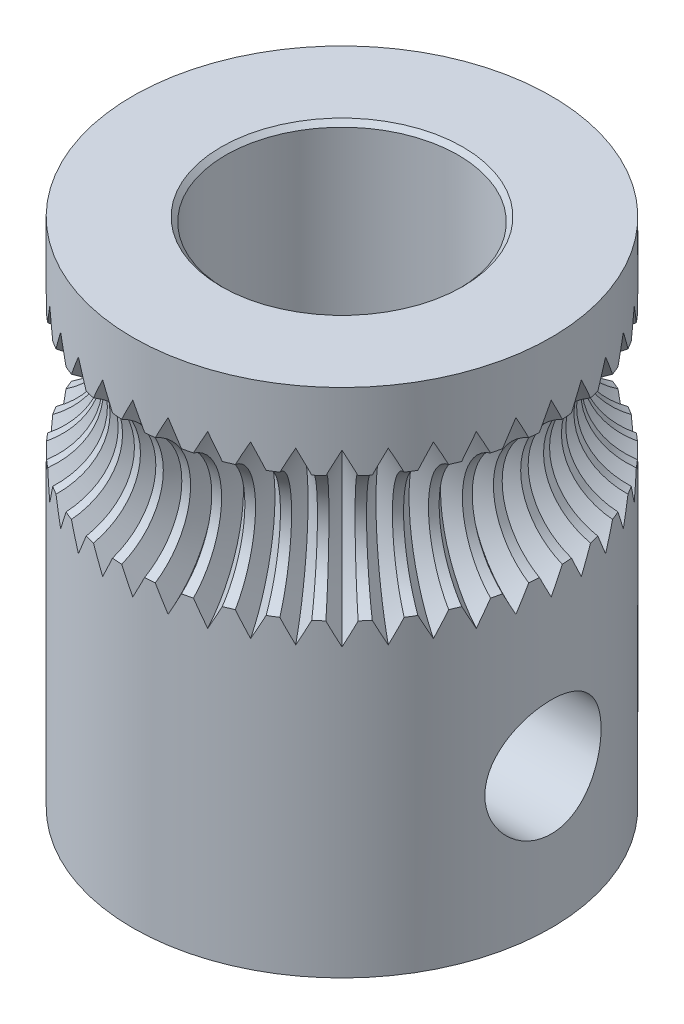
from build123d import *

# Parameters (mm, degrees)
CHAMFER_1_SIZE           = 0.1
PATTERN_CIRCULAR_1_COUNT = 40


with BuildPart() as part:
    # Sketch 1 → Revolve 1 (revolve)
    with BuildSketch(Plane.XY, mode=Mode.PRIVATE) as revolve_1_sk:
        with BuildLine():
            Line((2.5, 0), (2.5, 11))
            Line((2.5, 11), (4.5, 11))
            Line((4.5, 11), (4.5, 9.351850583))
            ThreePointArc((4.5, 9.351850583), (3.65, 8), (4.5, 6.648149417))
            Line((4.5, 6.648149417), (4.5, 0))
            Line((4.5, 0), (2.5, 0))
        make_face()
    revolve(revolve_1_sk.sketch.rotate(Axis((0, 28.496684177, 0), (0, -1, 0)), 90), axis=Axis((0, 28.496684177, 0), (0, -1, 0)))

    # Chamfer 1
    chamfer_1_edges = [part.edges().sort_by_distance(p)[0] for p in [
        (0, 0, -2.5),
        (0, 11, -2.5),
    ]]
    chamfer(chamfer_1_edges, length=CHAMFER_1_SIZE)

    # Sweep 1: sweep along a path in Sketch 2
    with BuildLine(Plane.XY) as sweep_1_path:
        CenterArc((5.3, 8), 1, 0, 360)
    # Sketch 3 → Sweep 1 (sweep, cut)
    with BuildSketch(Plane.XZ.offset(-8)):
        Polygon((7.3, 0), (6.575344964, -0.41837978), (6.575344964, 0.41837978), align=None)
    sweep_1 = sweep(path=sweep_1_path.line, mode=Mode.SUBTRACT)

    # Pattern Circular 1: Sweep 1 ×40 about axis
    pattern_circular_1_axis = Axis((0, 28.496684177, 0), (0, 1, 0))
    for i in range(1, PATTERN_CIRCULAR_1_COUNT):
        add(sweep_1.rotate(pattern_circular_1_axis, i * 360 / PATTERN_CIRCULAR_1_COUNT), mode=Mode.SUBTRACT)

    # Sketch 4 → Hole Wizard M31 (revolve, cut)
    with BuildSketch(Plane.ZX.offset(3)):
        Polygon((0, 0), (0, 9.251075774), (1.25, 8.5), (1.25, 0), align=None)
    revolve(axis=Axis((-6.35, 3, 0), (1, 0, 0)), mode=Mode.SUBTRACT)


solid = part.part
